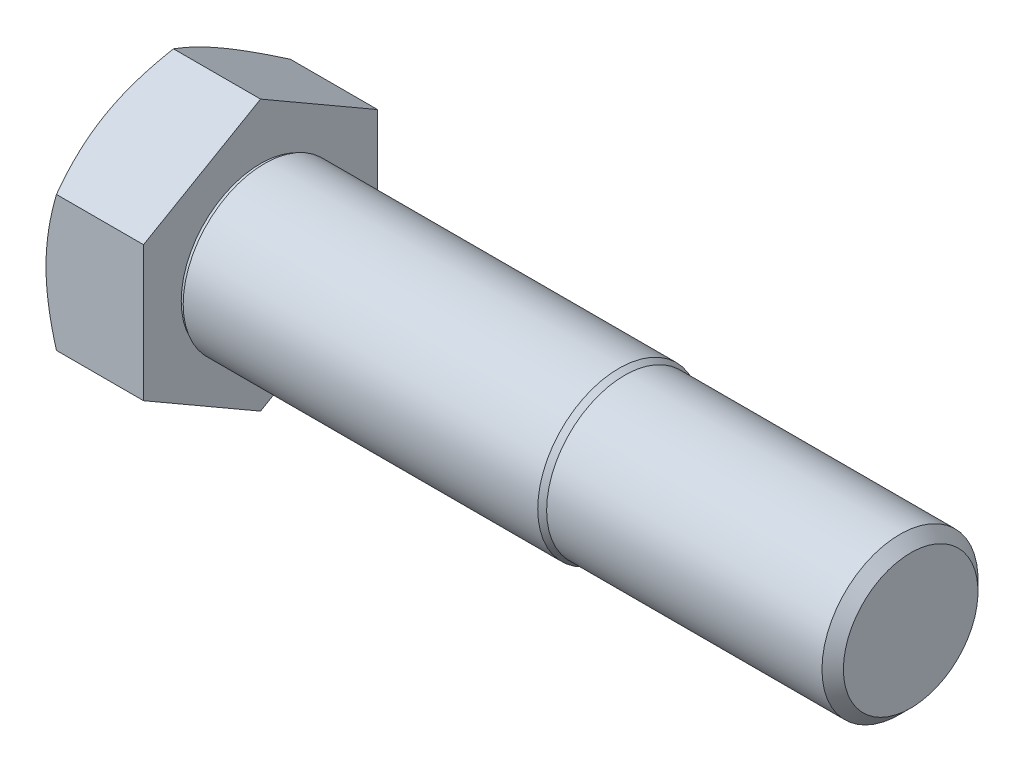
from build123d import *

# Parameters (mm, degrees)
BASEHEAD_DEPTH = 15


with BuildPart() as part:
    # BaseHeadSke → BaseHead (new body)
    with BuildSketch(Plane(origin=(0, 0, 0), x_dir=(0, 0, -1), z_dir=(1, 0, 0))):
        Polygon((0, 20.784609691), (-18, 10.392304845), (-18, -10.392304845), (0, -20.784609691), (18, -10.392304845), (18, 10.392304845), align=None)
    extrude(amount=BASEHEAD_DEPTH)

    # HeadChamferSke → HeadChamfer (revolve, cut)
    with BuildSketch(Plane.XY):
        Polygon((0, 20.784609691), (0, 18), (1.607695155, 20.784609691), align=None)
    revolve(axis=Axis((0, 0, 0), (1, 0, 0)), mode=Mode.SUBTRACT)

    # BodySke → BaseBody (revolve)
    with BuildSketch(Plane.XY, mode=Mode.PRIVATE) as basebody_sk:
        Polygon((15, 12.2), (15.6, 12.2), (15.6, 12.5), (70.133974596, 12.5), (71, 12), (113.352, 12), (115, 10.352), (115, 0), (15, 0), align=None)
    revolve(basebody_sk.sketch.rotate(Axis((0, 0, 0), (1, 0, 0)), 90), axis=Axis((0, 0, 0), (1, 0, 0)))


solid = part.part
